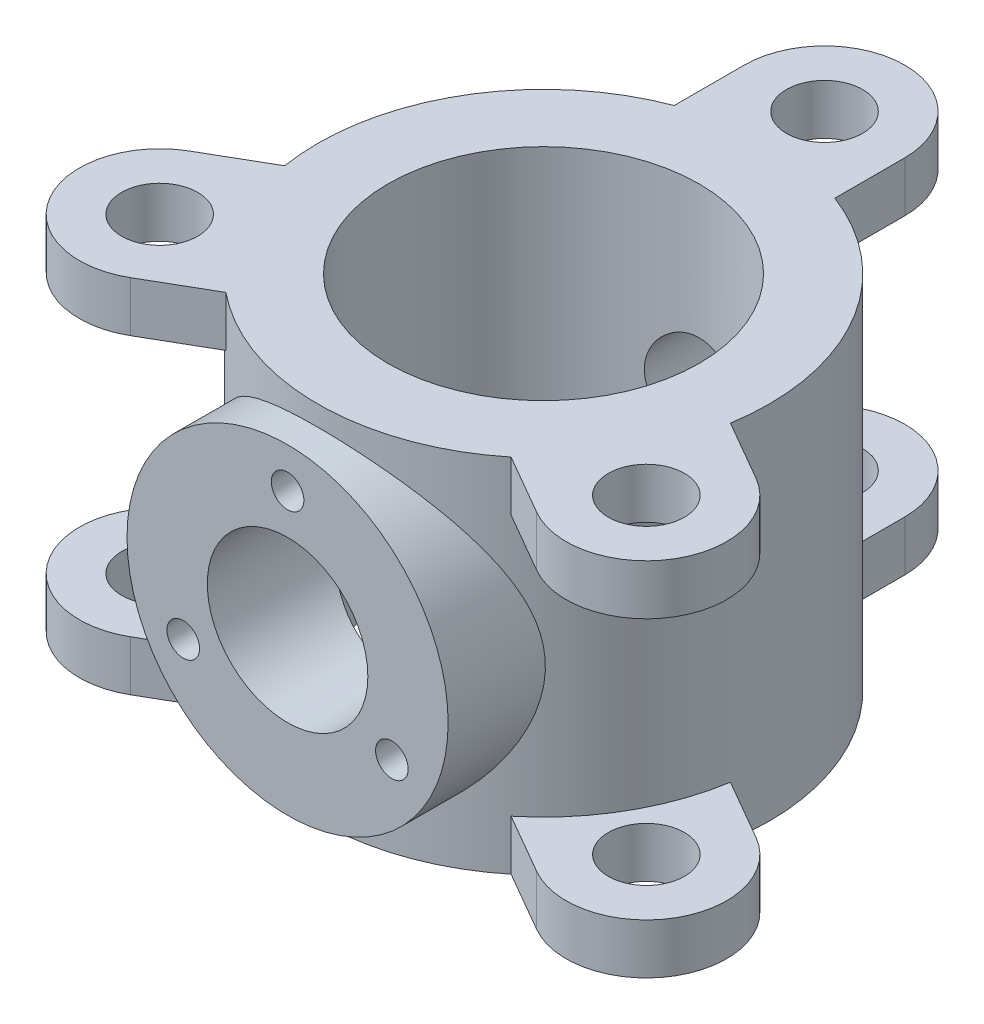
from build123d import *

# Parameters (mm, degrees)
SKETCH1_R          = 35.7124
EXTRUDE1_DEPTH     = 28.575
EXTRUDE2_START     = -7.9502
EXTRUDE2_DEPTH     = 7.9502
CIRPATTERN1_COUNT  = 3
HOLE1_D            = 12.0396
HOLE1_DEPTH        = 100
SKETCH6_R          = 25.4
SKETCH6_R_2        = 12.7
EXTRUDE3_DEPTH     = 40.4876
SKETCH10_R         = 24.6126
CUT_EXTRUDE1_DEPTH = 96.672125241
CUT_EXTRUDE2_REACH = 115.888
SKETCH9_R          = 12.7
HOLE2_D            = 5.1562
HOLE2_DEPTH        = 9.525
CIRPATTERN2_COUNT  = 3
SKETCH11_R         = 7.5
CUT_EXTRUDE3_DEPTH = 114.888287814


with BuildPart() as part:
    # Sketch1 → Extrude1 (new body)
    with BuildSketch(Plane(origin=(0, 0, 0), x_dir=(1, 0, 0), z_dir=(0, 1, 0))):
        with Locations(Location((0, 0, 0), (0, 0, 270))):
            Circle(SKETCH1_R)
    extrude(amount=EXTRUDE1_DEPTH)

    # Sketch2 → Extrude2 (add)
    with BuildSketch(Plane(origin=(0, 28.575, 0), x_dir=(-1, 0, 0), z_dir=(0, 1, 0)).offset(EXTRUDE2_START)):
        with BuildLine():
            Line((-12.7, -33.377919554), (-12.7, -44.45))
            ThreePointArc((-12.7, -44.45), (0, -57.15), (12.7, -44.45))
            Line((12.7, -44.45), (12.7, -33.377919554))
            ThreePointArc((12.7, -33.377919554), (0, -35.7124), (-12.7, -33.377919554))
        make_face()
    extrude2 = extrude(amount=EXTRUDE2_DEPTH)

    # CirPattern1: Extrude2 ×3 about axis
    cirpattern1_axis = Axis((0, 0, 0), (0, 1, 0))
    for i in range(1, CIRPATTERN1_COUNT):
        add(extrude2.rotate(cirpattern1_axis, i * 360 / CIRPATTERN1_COUNT))

    # Hole1
    with Locations(Plane(origin=(0, 28.575, 0), x_dir=(-1, 0, 0), z_dir=(0, 1, 0))):
        with Locations((38.494829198, 22.225), (0, -44.45), (-38.494829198, 22.225)):
            Hole(HOLE1_D / 2, depth=HOLE1_DEPTH)

    # Mirror1: part across plane


with BuildPart() as part_1:
    add(part.part)
    add(part.part.mirror(Plane.ZX))

    # Sketch6 → Extrude3 (add)
    with BuildSketch(Plane.XY):
        with Locations(Location((0, 0, 0), (0, 0, 180))):
            Circle(SKETCH6_R)
        with Locations(Location((0, 0, 0), (0, 0, 180))):
            Circle(SKETCH6_R_2, mode=Mode.SUBTRACT)
    extrude(amount=EXTRUDE3_DEPTH)

    # Sketch10 → Cut-Extrude1 (cut, through all)
    with BuildSketch(Plane(origin=(0, 28.575, 0), x_dir=(-1, 0, 0), z_dir=(0, 1, 0))):
        with Locations(Location((0, 0, 0), (0, 0, 90))):
            Circle(SKETCH10_R)
    extrude(amount=-CUT_EXTRUDE1_DEPTH, mode=Mode.SUBTRACT)

    # Sketch9 → Cut-Extrude2 (cut, up to next)
    with BuildSketch(Plane.XY.offset(40.4876), mode=Mode.PRIVATE) as cut_extrude2_sk1:
        Circle(SKETCH9_R)
    cut_extrude2_tool1 = extrude(cut_extrude2_sk1.sketch, amount=-CUT_EXTRUDE2_REACH, mode=Mode.PRIVATE) & part_1.part
    add(cut_extrude2_tool1.solids().sort_by_distance((0, 0, 40.4876))[0], mode=Mode.SUBTRACT)

    # Hole2
    with Locations(Plane.XY.offset(40.4876)):
        with Locations((0, 19.05)):
            hole2 = Hole(HOLE2_D / 2, depth=HOLE2_DEPTH)

    # CirPattern2: Hole2 ×3 about axis
    cirpattern2_axis = Axis((0, 0, 0), (0, 0, 1))
    for i in range(1, CIRPATTERN2_COUNT):
        add(hole2.rotate(cirpattern2_axis, i * 360 / CIRPATTERN2_COUNT), mode=Mode.SUBTRACT)

    # Sketch11 → Cut-Extrude3 (cut, through all)
    with BuildSketch(Plane.XY.offset(40.4876)):
        Circle(SKETCH11_R)
    extrude(amount=-CUT_EXTRUDE3_DEPTH, mode=Mode.SUBTRACT)

    # Sketch12 → Revolve1 (revolve)
    with BuildSketch(Plane(origin=(0, 0, 0), x_dir=(0, 0, -1), z_dir=(1, 0, 0)), mode=Mode.PRIVATE) as revolve1_sk:
        Polygon((34.1376, 7.5), (39.1249, 7.5), (39.1249, 0), (40.7124, 0), (40.7124, 9.0875), (34.1376, 9.0875), align=None)
    revolve(revolve1_sk.sketch.rotate(Axis((0, 0, 0), (0, 0, -1)), 90), axis=Axis((0, 0, 0), (0, 0, -1)))


solid = part_1.part
